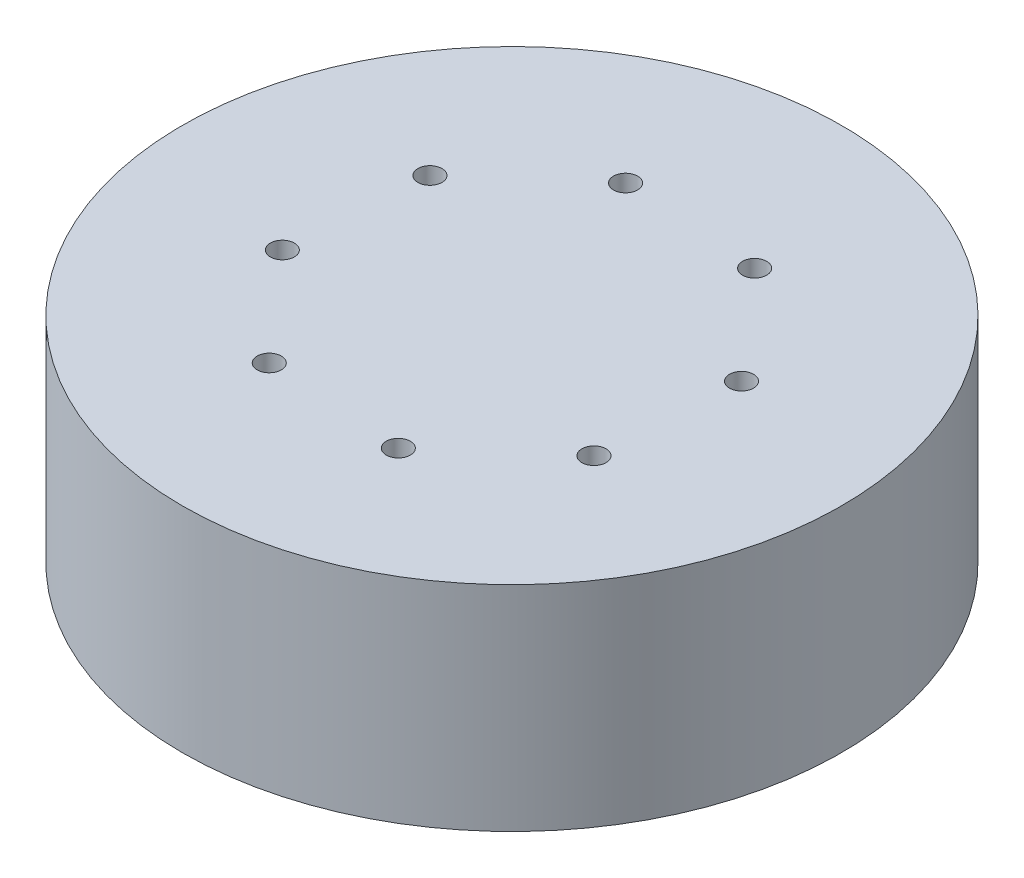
ISO-10303-21;
HEADER;
FILE_DESCRIPTION(('STEP AP214'),'2;1');
FILE_NAME('part.step','',(''),(''),'','','');
FILE_SCHEMA(('AUTOMOTIVE_DESIGN { 1 0 10303 214 1 1 1 1 }'));
ENDSEC;
DATA;
#1=APPLICATION_CONTEXT('core data for automotive mechanical design processes');
#2=APPLICATION_PROTOCOL_DEFINITION('international standard','automotive_design',2000,#1);
#3=PRODUCT_CONTEXT('',#1,'mechanical');
#4=PRODUCT('Part','Part','',(#3));
#5=PRODUCT_RELATED_PRODUCT_CATEGORY('part','',(#4));
#6=PRODUCT_DEFINITION_FORMATION('','',#4);
#7=PRODUCT_DEFINITION_CONTEXT('part definition',#1,'design');
#8=PRODUCT_DEFINITION('design','',#6,#7);
#9=PRODUCT_DEFINITION_SHAPE('','',#8);
#10=(LENGTH_UNIT() NAMED_UNIT(*) SI_UNIT(.MILLI.,.METRE.));
#11=(NAMED_UNIT(*) PLANE_ANGLE_UNIT() SI_UNIT($,.RADIAN.));
#12=(NAMED_UNIT(*) SI_UNIT($,.STERADIAN.) SOLID_ANGLE_UNIT());
#13=UNCERTAINTY_MEASURE_WITH_UNIT(LENGTH_MEASURE(1.E-05),#10,'distance_accuracy_value','');
#14=(GEOMETRIC_REPRESENTATION_CONTEXT(3) GLOBAL_UNCERTAINTY_ASSIGNED_CONTEXT((#13)) GLOBAL_UNIT_ASSIGNED_CONTEXT((#10,
#11,#12)) REPRESENTATION_CONTEXT('',''));
#15=CARTESIAN_POINT('',(0.,0.,0.));
#16=DIRECTION('',(0.,0.,1.));
#17=DIRECTION('',(1.,0.,0.));
#18=AXIS2_PLACEMENT_3D('',#15,#16,#17);
#19=CARTESIAN_POINT('',(0.,39.,0.));
#20=DIRECTION('',(0.,-1.,0.));
#21=DIRECTION('',(0.,0.,-1.));
#22=AXIS2_PLACEMENT_3D('',#19,#20,#21);
#23=CYLINDRICAL_SURFACE('',#22,60.1208838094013);
#24=CARTESIAN_POINT('',(0.,39.,0.));
#25=DIRECTION('',(0.,1.,0.));
#26=DIRECTION('',(0.,0.,1.));
#27=AXIS2_PLACEMENT_3D('',#24,#25,#26);
#28=CIRCLE('',#27,60.1208838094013);
#29=CARTESIAN_POINT('',(0.,39.,60.1208838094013));
#30=VERTEX_POINT('',#29);
#31=EDGE_CURVE('E10',#30,#30,#28,.T.);
#32=ORIENTED_EDGE('',*,*,#31,.F.);
#33=EDGE_LOOP('',(#32));
#34=FACE_BOUND('',#33,.T.);
#35=CARTESIAN_POINT('',(0.,0.,0.));
#36=DIRECTION('',(0.,1.,0.));
#37=DIRECTION('',(0.,0.,1.));
#38=AXIS2_PLACEMENT_3D('',#35,#36,#37);
#39=CIRCLE('',#38,60.1208838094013);
#40=CARTESIAN_POINT('',(0.,0.,60.1208838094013));
#41=VERTEX_POINT('',#40);
#42=EDGE_CURVE('E37',#41,#41,#39,.T.);
#43=ORIENTED_EDGE('',*,*,#42,.T.);
#44=EDGE_LOOP('',(#43));
#45=FACE_BOUND('',#44,.T.);
#46=ADVANCED_FACE('F31',(#34,#45),#23,.T.);
#47=CARTESIAN_POINT('',(0.,39.,0.));
#48=DIRECTION('',(0.,1.,0.));
#49=DIRECTION('',(0.,0.,1.));
#50=AXIS2_PLACEMENT_3D('',#47,#48,#49);
#51=PLANE('',#50);
#52=CARTESIAN_POINT('',(-10.5794710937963,39.,-31.3041228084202));
#53=DIRECTION('',(0.,1.,0.));
#54=DIRECTION('',(0.707106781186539,0.,0.707106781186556));
#55=AXIS2_PLACEMENT_3D('',#52,#53,#54);
#56=CIRCLE('',#55,2.19860866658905);
#57=CARTESIAN_POINT('',(-9.02481999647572,39.,-29.7494717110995));
#58=VERTEX_POINT('',#57);
#59=EDGE_CURVE('E89',#58,#58,#56,.T.);
#60=ORIENTED_EDGE('',*,*,#59,.F.);
#61=EDGE_LOOP('',(#60));
#62=FACE_BOUND('',#61,.T.);
#63=CARTESIAN_POINT('',(-29.6161732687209,39.,-14.6545417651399));
#64=DIRECTION('',(0.,1.,0.));
#65=DIRECTION('',(1.,0.,0.));
#66=AXIS2_PLACEMENT_3D('',#63,#64,#65);
#67=CIRCLE('',#66,2.19860866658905);
#68=CARTESIAN_POINT('',(-27.4175646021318,39.,-14.6545417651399));
#69=VERTEX_POINT('',#68);
#70=EDGE_CURVE('E83',#69,#69,#67,.T.);
#71=ORIENTED_EDGE('',*,*,#70,.F.);
#72=EDGE_LOOP('',(#71));
#73=FACE_BOUND('',#72,.T.);
#74=CARTESIAN_POINT('',(-31.3041228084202,39.,10.5794710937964));
#75=DIRECTION('',(0.,1.,0.));
#76=DIRECTION('',(0.707106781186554,0.,-0.707106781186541));
#77=AXIS2_PLACEMENT_3D('',#74,#75,#76);
#78=CIRCLE('',#77,2.19860866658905);
#79=CARTESIAN_POINT('',(-29.7494717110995,39.,9.02481999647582));
#80=VERTEX_POINT('',#79);
#81=EDGE_CURVE('E77',#80,#80,#78,.T.);
#82=ORIENTED_EDGE('',*,*,#81,.F.);
#83=EDGE_LOOP('',(#82));
#84=FACE_BOUND('',#83,.T.);
#85=CARTESIAN_POINT('',(-14.6545417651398,39.,29.6161732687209));
#86=DIRECTION('',(0.,1.,0.));
#87=DIRECTION('',(0.,0.,-1.));
#88=AXIS2_PLACEMENT_3D('',#85,#86,#87);
#89=CIRCLE('',#88,2.19860866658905);
#90=CARTESIAN_POINT('',(-14.6545417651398,39.,27.4175646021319));
#91=VERTEX_POINT('',#90);
#92=EDGE_CURVE('E71',#91,#91,#89,.T.);
#93=ORIENTED_EDGE('',*,*,#92,.F.);
#94=EDGE_LOOP('',(#93));
#95=FACE_BOUND('',#94,.T.);
#96=CARTESIAN_POINT('',(10.5794710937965,39.,31.3041228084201));
#97=DIRECTION('',(0.,1.,0.));
#98=DIRECTION('',(-0.707106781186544,0.,-0.707106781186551));
#99=AXIS2_PLACEMENT_3D('',#96,#97,#98);
#100=CIRCLE('',#99,2.19860866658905);
#101=CARTESIAN_POINT('',(9.02481999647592,39.,29.7494717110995));
#102=VERTEX_POINT('',#101);
#103=EDGE_CURVE('E65',#102,#102,#100,.T.);
#104=ORIENTED_EDGE('',*,*,#103,.F.);
#105=EDGE_LOOP('',(#104));
#106=FACE_BOUND('',#105,.T.);
#107=CARTESIAN_POINT('',(29.616173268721,39.,14.6545417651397));
#108=DIRECTION('',(0.,1.,0.));
#109=DIRECTION('',(-1.,0.,0.));
#110=AXIS2_PLACEMENT_3D('',#107,#108,#109);
#111=CIRCLE('',#110,2.19860866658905);
#112=CARTESIAN_POINT('',(27.4175646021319,39.,14.6545417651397));
#113=VERTEX_POINT('',#112);
#114=EDGE_CURVE('E59',#113,#113,#111,.T.);
#115=ORIENTED_EDGE('',*,*,#114,.F.);
#116=EDGE_LOOP('',(#115));
#117=FACE_BOUND('',#116,.T.);
#118=CARTESIAN_POINT('',(31.3041228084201,39.,-10.5794710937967));
#119=DIRECTION('',(0.,1.,0.));
#120=DIRECTION('',(-0.707106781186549,0.,0.707106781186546));
#121=AXIS2_PLACEMENT_3D('',#118,#119,#120);
#122=CIRCLE('',#121,2.19860866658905);
#123=CARTESIAN_POINT('',(29.7494717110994,39.,-9.02481999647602));
#124=VERTEX_POINT('',#123);
#125=EDGE_CURVE('E53',#124,#124,#122,.T.);
#126=ORIENTED_EDGE('',*,*,#125,.F.);
#127=EDGE_LOOP('',(#126));
#128=FACE_BOUND('',#127,.T.);
#129=CARTESIAN_POINT('',(14.6545417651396,39.,-29.616173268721));
#130=DIRECTION('',(0.,1.,0.));
#131=DIRECTION('',(0.,0.,1.));
#132=AXIS2_PLACEMENT_3D('',#129,#130,#131);
#133=CIRCLE('',#132,2.19860866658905);
#134=CARTESIAN_POINT('',(14.6545417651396,39.,-27.417564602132));
#135=VERTEX_POINT('',#134);
#136=EDGE_CURVE('E45',#135,#135,#133,.T.);
#137=ORIENTED_EDGE('',*,*,#136,.F.);
#138=EDGE_LOOP('',(#137));
#139=FACE_BOUND('',#138,.T.);
#140=ORIENTED_EDGE('',*,*,#31,.T.);
#141=EDGE_LOOP('',(#140));
#142=FACE_BOUND('',#141,.T.);
#143=ADVANCED_FACE('F95',(#62,#73,#84,#95,#106,#117,#128,#139,#142),#51,.T.);
#144=CARTESIAN_POINT('',(0.,0.,0.));
#145=DIRECTION('',(0.,1.,0.));
#146=DIRECTION('',(0.,0.,1.));
#147=AXIS2_PLACEMENT_3D('',#144,#145,#146);
#148=PLANE('',#147);
#149=CARTESIAN_POINT('',(-10.5794710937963,0.,-31.3041228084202));
#150=DIRECTION('',(0.,1.,0.));
#151=DIRECTION('',(0.707106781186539,0.,0.707106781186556));
#152=AXIS2_PLACEMENT_3D('',#149,#150,#151);
#153=CIRCLE('',#152,2.19860866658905);
#154=CARTESIAN_POINT('',(-9.02481999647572,0.,-29.7494717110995));
#155=VERTEX_POINT('',#154);
#156=EDGE_CURVE('E86',#155,#155,#153,.T.);
#157=ORIENTED_EDGE('',*,*,#156,.T.);
#158=EDGE_LOOP('',(#157));
#159=FACE_BOUND('',#158,.T.);
#160=CARTESIAN_POINT('',(-29.6161732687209,0.,-14.6545417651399));
#161=DIRECTION('',(0.,1.,0.));
#162=DIRECTION('',(1.,0.,0.));
#163=AXIS2_PLACEMENT_3D('',#160,#161,#162);
#164=CIRCLE('',#163,2.19860866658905);
#165=CARTESIAN_POINT('',(-27.4175646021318,0.,-14.6545417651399));
#166=VERTEX_POINT('',#165);
#167=EDGE_CURVE('E80',#166,#166,#164,.T.);
#168=ORIENTED_EDGE('',*,*,#167,.T.);
#169=EDGE_LOOP('',(#168));
#170=FACE_BOUND('',#169,.T.);
#171=CARTESIAN_POINT('',(-31.3041228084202,0.,10.5794710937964));
#172=DIRECTION('',(0.,1.,0.));
#173=DIRECTION('',(0.707106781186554,0.,-0.707106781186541));
#174=AXIS2_PLACEMENT_3D('',#171,#172,#173);
#175=CIRCLE('',#174,2.19860866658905);
#176=CARTESIAN_POINT('',(-29.7494717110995,0.,9.02481999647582));
#177=VERTEX_POINT('',#176);
#178=EDGE_CURVE('E74',#177,#177,#175,.T.);
#179=ORIENTED_EDGE('',*,*,#178,.T.);
#180=EDGE_LOOP('',(#179));
#181=FACE_BOUND('',#180,.T.);
#182=CARTESIAN_POINT('',(-14.6545417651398,0.,29.6161732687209));
#183=DIRECTION('',(0.,1.,0.));
#184=DIRECTION('',(0.,0.,-1.));
#185=AXIS2_PLACEMENT_3D('',#182,#183,#184);
#186=CIRCLE('',#185,2.19860866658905);
#187=CARTESIAN_POINT('',(-14.6545417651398,0.,27.4175646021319));
#188=VERTEX_POINT('',#187);
#189=EDGE_CURVE('E68',#188,#188,#186,.T.);
#190=ORIENTED_EDGE('',*,*,#189,.T.);
#191=EDGE_LOOP('',(#190));
#192=FACE_BOUND('',#191,.T.);
#193=CARTESIAN_POINT('',(10.5794710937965,0.,31.3041228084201));
#194=DIRECTION('',(0.,1.,0.));
#195=DIRECTION('',(-0.707106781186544,0.,-0.707106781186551));
#196=AXIS2_PLACEMENT_3D('',#193,#194,#195);
#197=CIRCLE('',#196,2.19860866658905);
#198=CARTESIAN_POINT('',(9.02481999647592,0.,29.7494717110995));
#199=VERTEX_POINT('',#198);
#200=EDGE_CURVE('E62',#199,#199,#197,.T.);
#201=ORIENTED_EDGE('',*,*,#200,.T.);
#202=EDGE_LOOP('',(#201));
#203=FACE_BOUND('',#202,.T.);
#204=CARTESIAN_POINT('',(29.616173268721,0.,14.6545417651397));
#205=DIRECTION('',(0.,1.,0.));
#206=DIRECTION('',(-1.,0.,0.));
#207=AXIS2_PLACEMENT_3D('',#204,#205,#206);
#208=CIRCLE('',#207,2.19860866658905);
#209=CARTESIAN_POINT('',(27.4175646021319,0.,14.6545417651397));
#210=VERTEX_POINT('',#209);
#211=EDGE_CURVE('E56',#210,#210,#208,.T.);
#212=ORIENTED_EDGE('',*,*,#211,.T.);
#213=EDGE_LOOP('',(#212));
#214=FACE_BOUND('',#213,.T.);
#215=CARTESIAN_POINT('',(31.3041228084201,0.,-10.5794710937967));
#216=DIRECTION('',(0.,1.,0.));
#217=DIRECTION('',(-0.707106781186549,0.,0.707106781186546));
#218=AXIS2_PLACEMENT_3D('',#215,#216,#217);
#219=CIRCLE('',#218,2.19860866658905);
#220=CARTESIAN_POINT('',(29.7494717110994,0.,-9.02481999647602));
#221=VERTEX_POINT('',#220);
#222=EDGE_CURVE('E50',#221,#221,#219,.T.);
#223=ORIENTED_EDGE('',*,*,#222,.T.);
#224=EDGE_LOOP('',(#223));
#225=FACE_BOUND('',#224,.T.);
#226=CARTESIAN_POINT('',(14.6545417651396,0.,-29.616173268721));
#227=DIRECTION('',(0.,1.,0.));
#228=DIRECTION('',(0.,0.,1.));
#229=AXIS2_PLACEMENT_3D('',#226,#227,#228);
#230=CIRCLE('',#229,2.19860866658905);
#231=CARTESIAN_POINT('',(14.6545417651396,0.,-27.417564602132));
#232=VERTEX_POINT('',#231);
#233=EDGE_CURVE('E41',#232,#232,#230,.T.);
#234=ORIENTED_EDGE('',*,*,#233,.T.);
#235=EDGE_LOOP('',(#234));
#236=FACE_BOUND('',#235,.T.);
#237=ORIENTED_EDGE('',*,*,#42,.F.);
#238=EDGE_LOOP('',(#237));
#239=FACE_BOUND('',#238,.T.);
#240=ADVANCED_FACE('F98',(#159,#170,#181,#192,#203,#214,#225,#236,#239),#148,.F.);
#241=CARTESIAN_POINT('',(14.6545417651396,0.,-29.616173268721));
#242=DIRECTION('',(0.,1.,0.));
#243=DIRECTION('',(0.,0.,1.));
#244=AXIS2_PLACEMENT_3D('',#241,#242,#243);
#245=CYLINDRICAL_SURFACE('',#244,2.19860866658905);
#246=ORIENTED_EDGE('',*,*,#233,.F.);
#247=EDGE_LOOP('',(#246));
#248=FACE_BOUND('',#247,.T.);
#249=ORIENTED_EDGE('',*,*,#136,.T.);
#250=EDGE_LOOP('',(#249));
#251=FACE_BOUND('',#250,.T.);
#252=ADVANCED_FACE('F113',(#248,#251),#245,.F.);
#253=CARTESIAN_POINT('',(31.3041228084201,0.,-10.5794710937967));
#254=DIRECTION('',(0.,1.,0.));
#255=DIRECTION('',(0.,0.,1.));
#256=AXIS2_PLACEMENT_3D('',#253,#254,#255);
#257=CYLINDRICAL_SURFACE('',#256,2.19860866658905);
#258=ORIENTED_EDGE('',*,*,#222,.F.);
#259=EDGE_LOOP('',(#258));
#260=FACE_BOUND('',#259,.T.);
#261=ORIENTED_EDGE('',*,*,#125,.T.);
#262=EDGE_LOOP('',(#261));
#263=FACE_BOUND('',#262,.T.);
#264=ADVANCED_FACE('F115',(#260,#263),#257,.F.);
#265=CARTESIAN_POINT('',(29.616173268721,0.,14.6545417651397));
#266=DIRECTION('',(0.,1.,0.));
#267=DIRECTION('',(0.,0.,1.));
#268=AXIS2_PLACEMENT_3D('',#265,#266,#267);
#269=CYLINDRICAL_SURFACE('',#268,2.19860866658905);
#270=ORIENTED_EDGE('',*,*,#211,.F.);
#271=EDGE_LOOP('',(#270));
#272=FACE_BOUND('',#271,.T.);
#273=ORIENTED_EDGE('',*,*,#114,.T.);
#274=EDGE_LOOP('',(#273));
#275=FACE_BOUND('',#274,.T.);
#276=ADVANCED_FACE('F122',(#272,#275),#269,.F.);
#277=CARTESIAN_POINT('',(10.5794710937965,0.,31.3041228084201));
#278=DIRECTION('',(0.,1.,0.));
#279=DIRECTION('',(0.,0.,1.));
#280=AXIS2_PLACEMENT_3D('',#277,#278,#279);
#281=CYLINDRICAL_SURFACE('',#280,2.19860866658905);
#282=ORIENTED_EDGE('',*,*,#200,.F.);
#283=EDGE_LOOP('',(#282));
#284=FACE_BOUND('',#283,.T.);
#285=ORIENTED_EDGE('',*,*,#103,.T.);
#286=EDGE_LOOP('',(#285));
#287=FACE_BOUND('',#286,.T.);
#288=ADVANCED_FACE('F153',(#284,#287),#281,.F.);
#289=CARTESIAN_POINT('',(-14.6545417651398,0.,29.6161732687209));
#290=DIRECTION('',(0.,1.,0.));
#291=DIRECTION('',(0.,0.,1.));
#292=AXIS2_PLACEMENT_3D('',#289,#290,#291);
#293=CYLINDRICAL_SURFACE('',#292,2.19860866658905);
#294=ORIENTED_EDGE('',*,*,#189,.F.);
#295=EDGE_LOOP('',(#294));
#296=FACE_BOUND('',#295,.T.);
#297=ORIENTED_EDGE('',*,*,#92,.T.);
#298=EDGE_LOOP('',(#297));
#299=FACE_BOUND('',#298,.T.);
#300=ADVANCED_FACE('F161',(#296,#299),#293,.F.);
#301=CARTESIAN_POINT('',(-31.3041228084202,0.,10.5794710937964));
#302=DIRECTION('',(0.,1.,0.));
#303=DIRECTION('',(0.,0.,1.));
#304=AXIS2_PLACEMENT_3D('',#301,#302,#303);
#305=CYLINDRICAL_SURFACE('',#304,2.19860866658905);
#306=ORIENTED_EDGE('',*,*,#178,.F.);
#307=EDGE_LOOP('',(#306));
#308=FACE_BOUND('',#307,.T.);
#309=ORIENTED_EDGE('',*,*,#81,.T.);
#310=EDGE_LOOP('',(#309));
#311=FACE_BOUND('',#310,.T.);
#312=ADVANCED_FACE('F169',(#308,#311),#305,.F.);
#313=CARTESIAN_POINT('',(-29.6161732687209,0.,-14.6545417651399));
#314=DIRECTION('',(0.,1.,0.));
#315=DIRECTION('',(0.,0.,1.));
#316=AXIS2_PLACEMENT_3D('',#313,#314,#315);
#317=CYLINDRICAL_SURFACE('',#316,2.19860866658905);
#318=ORIENTED_EDGE('',*,*,#167,.F.);
#319=EDGE_LOOP('',(#318));
#320=FACE_BOUND('',#319,.T.);
#321=ORIENTED_EDGE('',*,*,#70,.T.);
#322=EDGE_LOOP('',(#321));
#323=FACE_BOUND('',#322,.T.);
#324=ADVANCED_FACE('F177',(#320,#323),#317,.F.);
#325=CARTESIAN_POINT('',(-10.5794710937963,0.,-31.3041228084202));
#326=DIRECTION('',(0.,1.,0.));
#327=DIRECTION('',(0.,0.,1.));
#328=AXIS2_PLACEMENT_3D('',#325,#326,#327);
#329=CYLINDRICAL_SURFACE('',#328,2.19860866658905);
#330=ORIENTED_EDGE('',*,*,#156,.F.);
#331=EDGE_LOOP('',(#330));
#332=FACE_BOUND('',#331,.T.);
#333=ORIENTED_EDGE('',*,*,#59,.T.);
#334=EDGE_LOOP('',(#333));
#335=FACE_BOUND('',#334,.T.);
#336=ADVANCED_FACE('F93',(#332,#335),#329,.F.);
#337=CLOSED_SHELL('',(#46,#143,#240,#252,#264,#276,#288,#300,#312,#324,#336));
#338=MANIFOLD_SOLID_BREP('B2',#337);
#339=ADVANCED_BREP_SHAPE_REPRESENTATION('',(#18,#338),#14);
#340=SHAPE_DEFINITION_REPRESENTATION(#9,#339);
ENDSEC;
END-ISO-10303-21;
